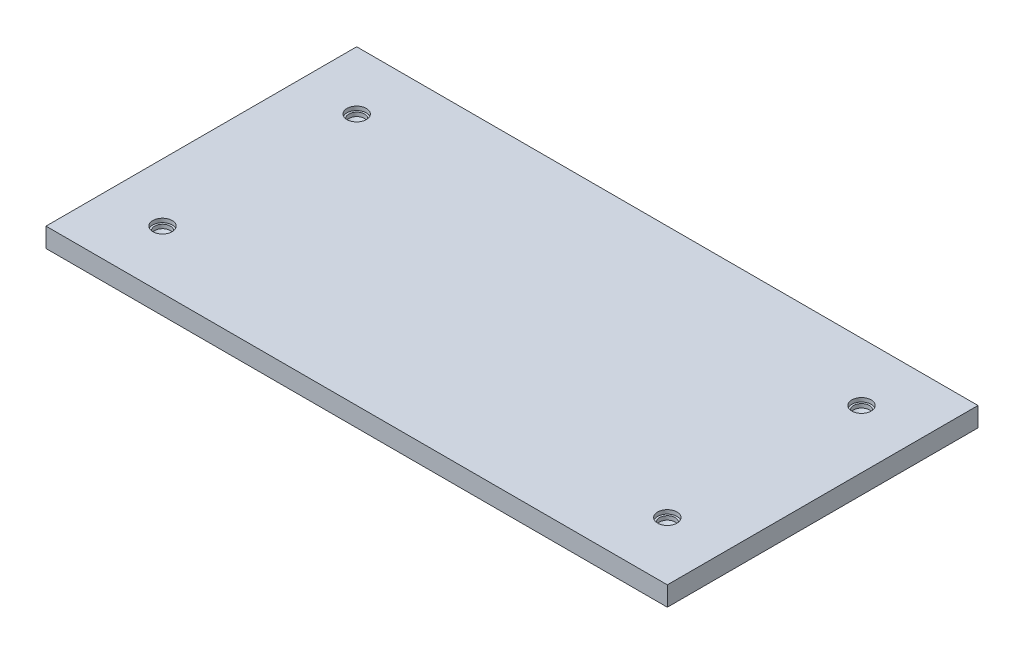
from build123d import *

# Parameters (mm, degrees)
SKETCH1_W           = 203.2
SKETCH1_H           = 101.6
BOSS_EXTRUDE1_DEPTH = 6.35


with BuildPart() as part:
    # Sketch1 → Boss-Extrude1 (new body)
    with BuildSketch(Plane(origin=(0, 0, 0), x_dir=(1, 0, 0), z_dir=(0, 1, 0))):
        Rectangle(SKETCH1_W, SKETCH1_H)
    extrude(amount=BOSS_EXTRUDE1_DEPTH)

    # Sketch3 → 1_4-20 Tapped Hole1 (revolve, cut)
    with BuildSketch(Plane(origin=(-82.55, 6.35, -31.75), x_dir=(0, 0, 1), z_dir=(1, 0, 0))):
        Polygon((0, 0), (0, 4.073816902), (2.5527, 2.54), (2.5527, 1.27), (3.175, 1.27), (3.175, 0), align=None)
    f_1_4_20_tapped_hole1 = revolve(axis=Axis((-82.55, 12.7, -31.75), (0, -1, 0)), mode=Mode.SUBTRACT)

    # Mirror1: 1_4-20 Tapped Hole1 across plane
    add(f_1_4_20_tapped_hole1.mirror(Plane(origin=(0, 0, 0), x_dir=(0, 0, 1), z_dir=(1, 0, 0))), mode=Mode.SUBTRACT)

    # Mirror2: 1_4-20 Tapped Hole1 across plane
    add(f_1_4_20_tapped_hole1.mirror(Plane.XY), mode=Mode.SUBTRACT)

    # Mirror2 copy 1 sketch → Mirror2 copy 1 (revolve, cut)
    with BuildSketch(Plane(origin=(82.55, 6.35, 31.75), x_dir=(0, 0, -1), z_dir=(-1, 0, 0))):
        Polygon((0, 0), (0, 4.073816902), (2.5527, 2.54), (2.5527, 1.27), (3.175, 1.27), (3.175, 0), align=None)
    revolve(axis=Axis((82.55, 12.7, 31.75), (0, -1, 0)), mode=Mode.SUBTRACT)


solid = part.part
